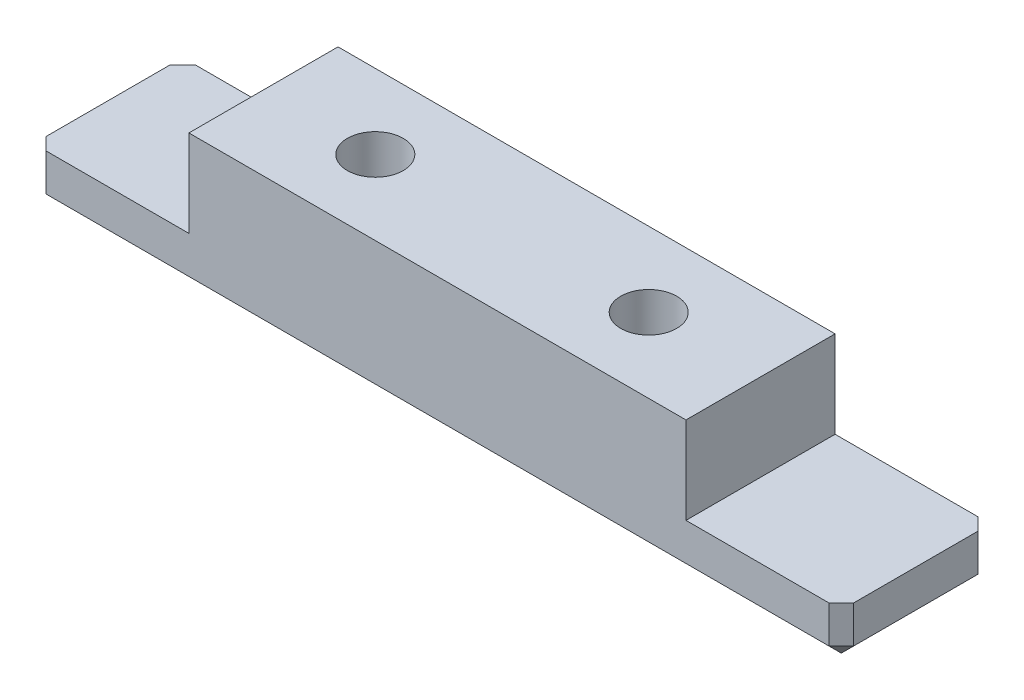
from build123d import *

# Parameters (mm, degrees)
BASE_EXTRUSION_DEPTH       = 6
CHANFREIN1_SIZE            = 1
PER_AGE1_D                 = 4.5
R_P_TITION_LIN_AIRE1_COUNT = 2
R_P_TITION_LIN_AIRE1_PITCH = 22


with BuildPart() as part:
    # Esquisse1 → Base-Extrusion (new, symmetric)
    with BuildSketch(Plane.XY):
        Polygon((-20, 0), (20, 0), (20, -7), (32.5, -7), (32.5, -11.004819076), (-32.5, -11.004819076), (-32.5, -7), (-20, -7), align=None)
    extrude(amount=BASE_EXTRUSION_DEPTH, both=True)

    # Chanfrein1
    chanfrein1_edges = [part.edges().sort_by_distance(p)[0] for p in [
        (32.5, -9.002409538, 6),
        (0, -11.004819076, 6),
        (-32.5, -9.002409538, 6),
        (-32.5, -9.002409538, -6),
        (-32.5, -11.004819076, 0),
        (0, -11.004819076, -6),
        (32.5, -11.004819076, 0),
        (32.5, -9.002409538, -6),
    ]]
    chamfer(chanfrein1_edges, length=CHANFREIN1_SIZE)

    # Per_age1 (through all)
    with Locations(Plane.XZ.offset(11.004819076)):
        with Locations((11, 0)):
            per_age1 = Hole(PER_AGE1_D / 2)

    # R_p_tition lin_aire1: Per_age1 ×2
    with Locations(*[(-i * R_P_TITION_LIN_AIRE1_PITCH, 0, 0) for i in range(1, R_P_TITION_LIN_AIRE1_COUNT)]):
        add(per_age1, mode=Mode.SUBTRACT)


solid = part.part
